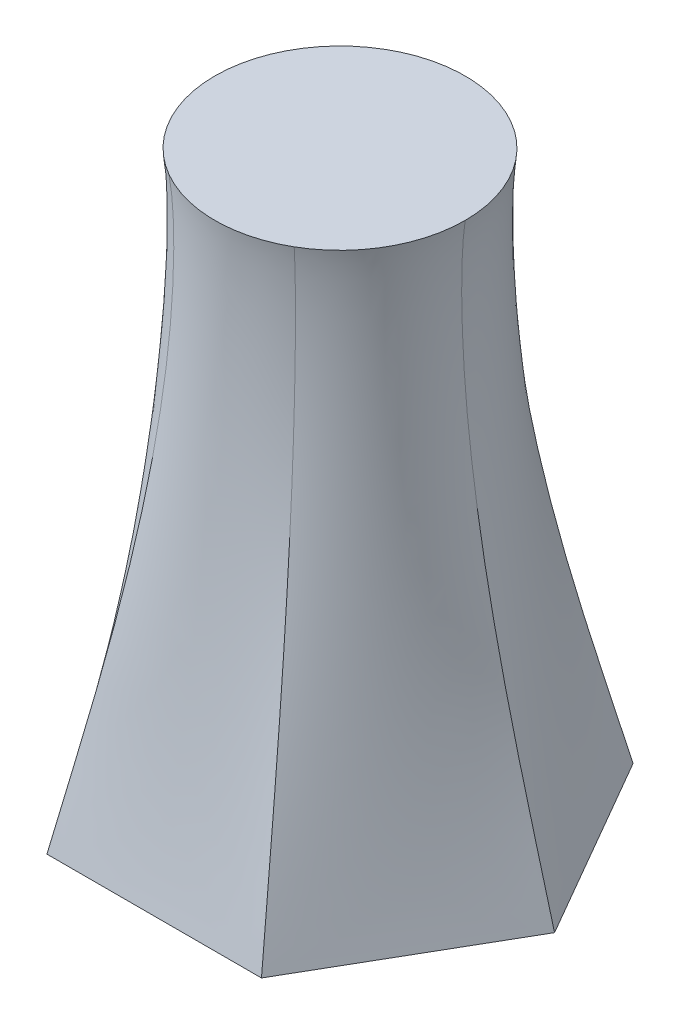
ISO-10303-21;
HEADER;
FILE_DESCRIPTION(('STEP AP214'),'2;1');
FILE_NAME('part.step','',(''),(''),'','','');
FILE_SCHEMA(('AUTOMOTIVE_DESIGN { 1 0 10303 214 1 1 1 1 }'));
ENDSEC;
DATA;
#1=APPLICATION_CONTEXT('core data for automotive mechanical design processes');
#2=APPLICATION_PROTOCOL_DEFINITION('international standard','automotive_design',2000,#1);
#3=PRODUCT_CONTEXT('',#1,'mechanical');
#4=PRODUCT('Part','Part','',(#3));
#5=PRODUCT_RELATED_PRODUCT_CATEGORY('part','',(#4));
#6=PRODUCT_DEFINITION_FORMATION('','',#4);
#7=PRODUCT_DEFINITION_CONTEXT('part definition',#1,'design');
#8=PRODUCT_DEFINITION('design','',#6,#7);
#9=PRODUCT_DEFINITION_SHAPE('','',#8);
#10=(LENGTH_UNIT() NAMED_UNIT(*) SI_UNIT(.MILLI.,.METRE.));
#11=(NAMED_UNIT(*) PLANE_ANGLE_UNIT() SI_UNIT($,.RADIAN.));
#12=(NAMED_UNIT(*) SI_UNIT($,.STERADIAN.) SOLID_ANGLE_UNIT());
#13=UNCERTAINTY_MEASURE_WITH_UNIT(LENGTH_MEASURE(1.E-05),#10,'distance_accuracy_value','');
#14=(GEOMETRIC_REPRESENTATION_CONTEXT(3) GLOBAL_UNCERTAINTY_ASSIGNED_CONTEXT((#13)) GLOBAL_UNIT_ASSIGNED_CONTEXT((#10,
#11,#12)) REPRESENTATION_CONTEXT('',''));
#15=CARTESIAN_POINT('',(0.,0.,0.));
#16=DIRECTION('',(0.,0.,1.));
#17=DIRECTION('',(1.,0.,0.));
#18=AXIS2_PLACEMENT_3D('',#15,#16,#17);
#19=CARTESIAN_POINT('',(0.,160.,0.));
#20=DIRECTION('',(0.,1.,0.));
#21=DIRECTION('',(0.,0.,1.));
#22=AXIS2_PLACEMENT_3D('',#19,#20,#21);
#23=PLANE('',#22);
#24=CARTESIAN_POINT('',(0.,160.,0.));
#25=DIRECTION('',(0.,1.,0.));
#26=DIRECTION('',(0.,0.,1.));
#27=AXIS2_PLACEMENT_3D('',#24,#25,#26);
#28=CIRCLE('',#27,35.);
#29=CARTESIAN_POINT('',(17.5,160.,30.3108891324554));
#30=VERTEX_POINT('',#29);
#31=CARTESIAN_POINT('',(35.,160.,0.));
#32=VERTEX_POINT('',#31);
#33=EDGE_CURVE('E143',#30,#32,#28,.T.);
#34=ORIENTED_EDGE('',*,*,#33,.T.);
#35=CARTESIAN_POINT('',(17.5,160.,-30.3108891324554));
#36=VERTEX_POINT('',#35);
#37=EDGE_CURVE('E152',#32,#36,#28,.T.);
#38=ORIENTED_EDGE('',*,*,#37,.T.);
#39=CARTESIAN_POINT('',(-17.5,160.,-30.3108891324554));
#40=VERTEX_POINT('',#39);
#41=EDGE_CURVE('E180',#36,#40,#28,.T.);
#42=ORIENTED_EDGE('',*,*,#41,.T.);
#43=CARTESIAN_POINT('',(-35.,160.,0.));
#44=VERTEX_POINT('',#43);
#45=EDGE_CURVE('E163',#40,#44,#28,.T.);
#46=ORIENTED_EDGE('',*,*,#45,.T.);
#47=CARTESIAN_POINT('',(-17.5,160.,30.3108891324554));
#48=VERTEX_POINT('',#47);
#49=EDGE_CURVE('E157',#44,#48,#28,.T.);
#50=ORIENTED_EDGE('',*,*,#49,.T.);
#51=EDGE_CURVE('E135',#48,#30,#28,.T.);
#52=ORIENTED_EDGE('',*,*,#51,.T.);
#53=EDGE_LOOP('',(#34,#38,#42,#46,#50,#52));
#54=FACE_BOUND('',#53,.T.);
#55=ADVANCED_FACE('F75',(#54),#23,.T.);
#56=CARTESIAN_POINT('',(30.,0.,51.9615242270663));
#57=DIRECTION('',(0.,-1.,0.));
#58=DIRECTION('',(0.,0.,-1.));
#59=AXIS2_PLACEMENT_3D('',#56,#57,#58);
#60=PLANE('',#59);
#61=DIRECTION('',(0.499999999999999,0.,-0.866025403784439));
#62=VECTOR('',#61,1.);
#63=CARTESIAN_POINT('',(30.,0.,51.9615242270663));
#64=LINE('',#63,#62);
#65=CARTESIAN_POINT('',(30.,0.,51.9615242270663));
#66=VERTEX_POINT('',#65);
#67=CARTESIAN_POINT('',(60.,0.,0.));
#68=VERTEX_POINT('',#67);
#69=EDGE_CURVE('E139',#66,#68,#64,.T.);
#70=ORIENTED_EDGE('',*,*,#69,.F.);
#71=DIRECTION('',(1.,0.,0.));
#72=VECTOR('',#71,1.);
#73=CARTESIAN_POINT('',(-30.,0.,51.9615242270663));
#74=LINE('',#73,#72);
#75=CARTESIAN_POINT('',(-30.,0.,51.9615242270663));
#76=VERTEX_POINT('',#75);
#77=EDGE_CURVE('E12',#76,#66,#74,.T.);
#78=ORIENTED_EDGE('',*,*,#77,.F.);
#79=DIRECTION('',(0.5,0.,0.866025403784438));
#80=VECTOR('',#79,1.);
#81=CARTESIAN_POINT('',(-60.,0.,0.));
#82=LINE('',#81,#80);
#83=CARTESIAN_POINT('',(-60.,0.,0.));
#84=VERTEX_POINT('',#83);
#85=EDGE_CURVE('E87',#84,#76,#82,.T.);
#86=ORIENTED_EDGE('',*,*,#85,.F.);
#87=DIRECTION('',(-0.5,0.,0.866025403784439));
#88=VECTOR('',#87,1.);
#89=CARTESIAN_POINT('',(-30.,0.,-51.9615242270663));
#90=LINE('',#89,#88);
#91=CARTESIAN_POINT('',(-30.,0.,-51.9615242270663));
#92=VERTEX_POINT('',#91);
#93=EDGE_CURVE('E252',#92,#84,#90,.T.);
#94=ORIENTED_EDGE('',*,*,#93,.F.);
#95=DIRECTION('',(-1.,0.,0.));
#96=VECTOR('',#95,1.);
#97=CARTESIAN_POINT('',(30.,0.,-51.9615242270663));
#98=LINE('',#97,#96);
#99=CARTESIAN_POINT('',(30.,0.,-51.9615242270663));
#100=VERTEX_POINT('',#99);
#101=EDGE_CURVE('E234',#100,#92,#98,.T.);
#102=ORIENTED_EDGE('',*,*,#101,.F.);
#103=DIRECTION('',(-0.5,0.,-0.866025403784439));
#104=VECTOR('',#103,1.);
#105=CARTESIAN_POINT('',(60.,0.,0.));
#106=LINE('',#105,#104);
#107=EDGE_CURVE('E336',#68,#100,#106,.T.);
#108=ORIENTED_EDGE('',*,*,#107,.F.);
#109=EDGE_LOOP('',(#70,#78,#86,#94,#102,#108));
#110=FACE_BOUND('',#109,.T.);
#111=ADVANCED_FACE('F77',(#110),#60,.T.);
#112=CARTESIAN_POINT('',(-30.,0.,51.9615242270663));
#113=CARTESIAN_POINT('',(-26.5443279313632,26.4548247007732,45.9761246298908));
#114=CARTESIAN_POINT('',(-17.0487314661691,88.2729550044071,29.5292691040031));
#115=CARTESIAN_POINT('',(-16.822105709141,150.899269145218,29.1367417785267));
#116=CARTESIAN_POINT('',(-17.5,160.,30.3108891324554));
#117=CARTESIAN_POINT('',(-10.,0.,51.9615242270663));
#118=CARTESIAN_POINT('',(-8.8481093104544,26.4548247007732,45.9761246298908));
#119=CARTESIAN_POINT('',(-6.65982607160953,88.2729550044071,36.8062666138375));
#120=CARTESIAN_POINT('',(-6.44657854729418,150.899269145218,35.3879768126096));
#121=CARTESIAN_POINT('',(-6.67254331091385,160.,36.5621241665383));
#122=CARTESIAN_POINT('',(9.99999999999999,0.,51.9615242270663));
#123=CARTESIAN_POINT('',(8.8481093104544,26.4548247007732,45.9761246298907));
#124=CARTESIAN_POINT('',(6.65982607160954,88.2729550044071,36.8062666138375));
#125=CARTESIAN_POINT('',(6.44657854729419,150.899269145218,35.3879768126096));
#126=CARTESIAN_POINT('',(6.67254331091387,160.,36.5621241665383));
#127=CARTESIAN_POINT('',(30.,0.,51.9615242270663));
#128=CARTESIAN_POINT('',(26.5443279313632,26.4548247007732,45.9761246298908));
#129=CARTESIAN_POINT('',(17.0487314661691,88.2729550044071,29.5292691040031));
#130=CARTESIAN_POINT('',(16.822105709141,150.899269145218,29.1367417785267));
#131=CARTESIAN_POINT('',(17.5,160.,30.3108891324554));
#132=B_SPLINE_SURFACE_WITH_KNOTS('',3,3,((#112,#113,#114,#115,#116),(#117,#118,#119,#120,#121),
(#122,#123,#124,#125,#126),(#127,#128,#129,#130,#131)),.UNSPECIFIED.,.F.,.F.,.F.,(4,4),(4,1,4),
(0.,1.),(0.,0.752910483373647,1.),.UNSPECIFIED.);
#133=CARTESIAN_POINT('',(30.,0.,51.9615242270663));
#134=CARTESIAN_POINT('',(26.5443279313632,26.4548247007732,45.9761246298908));
#135=CARTESIAN_POINT('',(17.0487314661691,88.2729550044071,29.5292691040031));
#136=CARTESIAN_POINT('',(16.822105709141,150.899269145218,29.1367417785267));
#137=CARTESIAN_POINT('',(17.5,160.,30.3108891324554));
#138=B_SPLINE_CURVE_WITH_KNOTS('',3,(#133,#134,#135,#136,#137),.UNSPECIFIED.,.F.,.F.,(4,1,4),
(0.,0.752910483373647,1.),.UNSPECIFIED.);
#139=EDGE_CURVE('E95',#66,#30,#138,.T.);
#140=CARTESIAN_POINT('',(-30.,0.,51.9615242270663));
#141=CARTESIAN_POINT('',(-26.5443279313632,26.4548247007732,45.9761246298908));
#142=CARTESIAN_POINT('',(-17.0487314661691,88.2729550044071,29.5292691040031));
#143=CARTESIAN_POINT('',(-16.822105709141,150.899269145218,29.1367417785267));
#144=CARTESIAN_POINT('',(-17.5,160.,30.3108891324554));
#145=B_SPLINE_CURVE_WITH_KNOTS('',3,(#140,#141,#142,#143,#144),.UNSPECIFIED.,.F.,.F.,(4,1,4),
(0.,0.752910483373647,1.),.UNSPECIFIED.);
#146=EDGE_CURVE('E140',#48,#76,#145,.F.);
#147=ORIENTED_EDGE('',*,*,#77,.T.);
#148=ORIENTED_EDGE('',*,*,#139,.T.);
#149=ORIENTED_EDGE('',*,*,#51,.F.);
#150=ORIENTED_EDGE('',*,*,#146,.T.);
#151=EDGE_LOOP('',(#147,#148,#149,#150));
#152=FACE_BOUND('',#151,.T.);
#153=ADVANCED_FACE('F132',(#152),#132,.T.);
#154=CARTESIAN_POINT('',(30.,0.,51.9615242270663));
#155=CARTESIAN_POINT('',(26.5443279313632,26.4548247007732,45.9761246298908));
#156=CARTESIAN_POINT('',(17.0487314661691,88.2729550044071,29.5292691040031));
#157=CARTESIAN_POINT('',(16.822105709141,150.899269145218,29.1367417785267));
#158=CARTESIAN_POINT('',(17.5,160.,30.3108891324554));
#159=CARTESIAN_POINT('',(40.,0.,34.6410161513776));
#160=CARTESIAN_POINT('',(35.3924372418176,26.4548247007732,30.6507497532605));
#161=CARTESIAN_POINT('',(28.5452488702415,88.2729550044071,24.1707118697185));
#162=CARTESIAN_POINT('',(27.4235976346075,150.899269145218,23.2768891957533));
#163=CARTESIAN_POINT('',(28.3274566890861,160.,24.0596540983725));
#164=CARTESIAN_POINT('',(50.,0.,17.3205080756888));
#165=CARTESIAN_POINT('',(44.240546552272,26.4548247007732,15.3253748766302));
#166=CARTESIAN_POINT('',(35.2050749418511,88.2729550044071,12.635554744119));
#167=CARTESIAN_POINT('',(33.8701761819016,150.899269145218,12.1110876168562));
#168=CARTESIAN_POINT('',(35.,160.,12.5024700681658));
#169=CARTESIAN_POINT('',(60.,0.,0.));
#170=CARTESIAN_POINT('',(53.0886558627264,26.4548247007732,0.));
#171=CARTESIAN_POINT('',(34.0974629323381,88.2729550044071,0.));
#172=CARTESIAN_POINT('',(33.644211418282,150.899269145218,0.));
#173=CARTESIAN_POINT('',(35.,160.,0.));
#174=B_SPLINE_SURFACE_WITH_KNOTS('',3,3,((#154,#155,#156,#157,#158),(#159,#160,#161,#162,#163),
(#164,#165,#166,#167,#168),(#169,#170,#171,#172,#173)),.UNSPECIFIED.,.F.,.F.,.F.,(4,4),(4,1,4),
(0.,1.),(0.,0.752910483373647,1.),.UNSPECIFIED.);
#175=CARTESIAN_POINT('',(60.,0.,0.));
#176=CARTESIAN_POINT('',(53.0886558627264,26.4548247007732,0.));
#177=CARTESIAN_POINT('',(34.0974629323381,88.2729550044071,0.));
#178=CARTESIAN_POINT('',(33.644211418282,150.899269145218,0.));
#179=CARTESIAN_POINT('',(35.,160.,0.));
#180=B_SPLINE_CURVE_WITH_KNOTS('',3,(#175,#176,#177,#178,#179),.UNSPECIFIED.,.F.,.F.,(4,1,4),
(0.,0.752910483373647,1.),.UNSPECIFIED.);
#181=EDGE_CURVE('E147',#68,#32,#180,.T.);
#182=ORIENTED_EDGE('',*,*,#69,.T.);
#183=ORIENTED_EDGE('',*,*,#181,.T.);
#184=ORIENTED_EDGE('',*,*,#33,.F.);
#185=ORIENTED_EDGE('',*,*,#139,.F.);
#186=EDGE_LOOP('',(#182,#183,#184,#185));
#187=FACE_BOUND('',#186,.T.);
#188=ADVANCED_FACE('F145',(#187),#174,.T.);
#189=CARTESIAN_POINT('',(-60.,0.,0.));
#190=CARTESIAN_POINT('',(-53.0886558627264,26.4548247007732,0.));
#191=CARTESIAN_POINT('',(-34.0974629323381,88.2729550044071,0.));
#192=CARTESIAN_POINT('',(-33.644211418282,150.899269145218,0.));
#193=CARTESIAN_POINT('',(-35.,160.,0.));
#194=CARTESIAN_POINT('',(-50.,0.,17.3205080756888));
#195=CARTESIAN_POINT('',(-44.240546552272,26.4548247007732,15.3253748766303));
#196=CARTESIAN_POINT('',(-35.2050749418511,88.2729550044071,12.635554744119));
#197=CARTESIAN_POINT('',(-33.8701761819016,150.899269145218,12.1110876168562));
#198=CARTESIAN_POINT('',(-35.,160.,12.5024700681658));
#199=CARTESIAN_POINT('',(-40.,0.,34.6410161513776));
#200=CARTESIAN_POINT('',(-35.3924372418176,26.4548247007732,30.6507497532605));
#201=CARTESIAN_POINT('',(-28.5452488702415,88.2729550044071,24.1707118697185));
#202=CARTESIAN_POINT('',(-27.4235976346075,150.899269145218,23.2768891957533));
#203=CARTESIAN_POINT('',(-28.3274566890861,160.,24.0596540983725));
#204=CARTESIAN_POINT('',(-30.,0.,51.9615242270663));
#205=CARTESIAN_POINT('',(-26.5443279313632,26.4548247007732,45.9761246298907));
#206=CARTESIAN_POINT('',(-17.0487314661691,88.2729550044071,29.5292691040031));
#207=CARTESIAN_POINT('',(-16.822105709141,150.899269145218,29.1367417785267));
#208=CARTESIAN_POINT('',(-17.5,160.,30.3108891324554));
#209=B_SPLINE_SURFACE_WITH_KNOTS('',3,3,((#189,#190,#191,#192,#193),(#194,#195,#196,#197,#198),
(#199,#200,#201,#202,#203),(#204,#205,#206,#207,#208)),.UNSPECIFIED.,.F.,.F.,.F.,(4,4),(4,1,4),
(0.,1.),(0.,0.752910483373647,1.),.UNSPECIFIED.);
#210=CARTESIAN_POINT('',(-60.,0.,0.));
#211=CARTESIAN_POINT('',(-53.0886558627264,26.4548247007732,0.));
#212=CARTESIAN_POINT('',(-34.0974629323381,88.2729550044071,0.));
#213=CARTESIAN_POINT('',(-33.644211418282,150.899269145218,0.));
#214=CARTESIAN_POINT('',(-35.,160.,0.));
#215=B_SPLINE_CURVE_WITH_KNOTS('',3,(#210,#211,#212,#213,#214),.UNSPECIFIED.,.F.,.F.,(4,1,4),
(0.,0.752910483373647,1.),.UNSPECIFIED.);
#216=EDGE_CURVE('E151',#84,#44,#215,.T.);
#217=ORIENTED_EDGE('',*,*,#85,.T.);
#218=ORIENTED_EDGE('',*,*,#146,.F.);
#219=ORIENTED_EDGE('',*,*,#49,.F.);
#220=ORIENTED_EDGE('',*,*,#216,.F.);
#221=EDGE_LOOP('',(#217,#218,#219,#220));
#222=FACE_BOUND('',#221,.T.);
#223=ADVANCED_FACE('F273',(#222),#209,.T.);
#224=CARTESIAN_POINT('',(60.,0.,0.));
#225=CARTESIAN_POINT('',(53.0886558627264,26.4548247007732,0.));
#226=CARTESIAN_POINT('',(34.0974629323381,88.2729550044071,0.));
#227=CARTESIAN_POINT('',(33.644211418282,150.899269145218,0.));
#228=CARTESIAN_POINT('',(35.,160.,0.));
#229=CARTESIAN_POINT('',(50.,0.,-17.3205080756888));
#230=CARTESIAN_POINT('',(44.240546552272,26.4548247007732,-15.3253748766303));
#231=CARTESIAN_POINT('',(35.2050749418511,88.2729550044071,-12.635554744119));
#232=CARTESIAN_POINT('',(33.8701761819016,150.899269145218,-12.1110876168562));
#233=CARTESIAN_POINT('',(35.,160.,-12.5024700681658));
#234=CARTESIAN_POINT('',(40.,0.,-34.6410161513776));
#235=CARTESIAN_POINT('',(35.3924372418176,26.4548247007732,-30.6507497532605));
#236=CARTESIAN_POINT('',(28.5452488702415,88.2729550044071,-24.1707118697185));
#237=CARTESIAN_POINT('',(27.4235976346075,150.899269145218,-23.2768891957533));
#238=CARTESIAN_POINT('',(28.3274566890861,160.,-24.0596540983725));
#239=CARTESIAN_POINT('',(30.,0.,-51.9615242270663));
#240=CARTESIAN_POINT('',(26.5443279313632,26.4548247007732,-45.9761246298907));
#241=CARTESIAN_POINT('',(17.0487314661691,88.2729550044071,-29.5292691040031));
#242=CARTESIAN_POINT('',(16.822105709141,150.899269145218,-29.1367417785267));
#243=CARTESIAN_POINT('',(17.5,160.,-30.3108891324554));
#244=B_SPLINE_SURFACE_WITH_KNOTS('',3,3,((#224,#225,#226,#227,#228),(#229,#230,#231,#232,#233),
(#234,#235,#236,#237,#238),(#239,#240,#241,#242,#243)),.UNSPECIFIED.,.F.,.F.,.F.,(4,4),(4,1,4),
(0.,1.),(0.,0.752910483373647,1.),.UNSPECIFIED.);
#245=CARTESIAN_POINT('',(30.,0.,-51.9615242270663));
#246=CARTESIAN_POINT('',(26.5443279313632,26.4548247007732,-45.9761246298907));
#247=CARTESIAN_POINT('',(17.0487314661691,88.2729550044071,-29.5292691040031));
#248=CARTESIAN_POINT('',(16.822105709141,150.899269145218,-29.1367417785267));
#249=CARTESIAN_POINT('',(17.5,160.,-30.3108891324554));
#250=B_SPLINE_CURVE_WITH_KNOTS('',3,(#245,#246,#247,#248,#249),.UNSPECIFIED.,.F.,.F.,(4,1,4),
(0.,0.752910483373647,1.),.UNSPECIFIED.);
#251=EDGE_CURVE('E236',#100,#36,#250,.T.);
#252=ORIENTED_EDGE('',*,*,#107,.T.);
#253=ORIENTED_EDGE('',*,*,#251,.T.);
#254=ORIENTED_EDGE('',*,*,#37,.F.);
#255=ORIENTED_EDGE('',*,*,#181,.F.);
#256=EDGE_LOOP('',(#252,#253,#254,#255));
#257=FACE_BOUND('',#256,.T.);
#258=ADVANCED_FACE('F285',(#257),#244,.T.);
#259=CARTESIAN_POINT('',(30.,0.,-51.9615242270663));
#260=CARTESIAN_POINT('',(26.5443279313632,26.4548247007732,-45.9761246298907));
#261=CARTESIAN_POINT('',(17.0487314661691,88.2729550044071,-29.5292691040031));
#262=CARTESIAN_POINT('',(16.822105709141,150.899269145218,-29.1367417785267));
#263=CARTESIAN_POINT('',(17.5,160.,-30.3108891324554));
#264=CARTESIAN_POINT('',(9.99999999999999,0.,-51.9615242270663));
#265=CARTESIAN_POINT('',(8.84810931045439,26.4548247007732,-45.9761246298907));
#266=CARTESIAN_POINT('',(6.65982607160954,88.2729550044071,-36.8062666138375));
#267=CARTESIAN_POINT('',(6.44657854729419,150.899269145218,-35.3879768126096));
#268=CARTESIAN_POINT('',(6.67254331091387,160.,-36.5621241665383));
#269=CARTESIAN_POINT('',(-10.,0.,-51.9615242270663));
#270=CARTESIAN_POINT('',(-8.8481093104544,26.4548247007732,-45.9761246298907));
#271=CARTESIAN_POINT('',(-6.65982607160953,88.2729550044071,-36.8062666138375));
#272=CARTESIAN_POINT('',(-6.44657854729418,150.899269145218,-35.3879768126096));
#273=CARTESIAN_POINT('',(-6.67254331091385,160.,-36.5621241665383));
#274=CARTESIAN_POINT('',(-30.,0.,-51.9615242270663));
#275=CARTESIAN_POINT('',(-26.5443279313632,26.4548247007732,-45.9761246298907));
#276=CARTESIAN_POINT('',(-17.0487314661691,88.2729550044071,-29.5292691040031));
#277=CARTESIAN_POINT('',(-16.822105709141,150.899269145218,-29.1367417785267));
#278=CARTESIAN_POINT('',(-17.5,160.,-30.3108891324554));
#279=B_SPLINE_SURFACE_WITH_KNOTS('',3,3,((#259,#260,#261,#262,#263),(#264,#265,#266,#267,#268),
(#269,#270,#271,#272,#273),(#274,#275,#276,#277,#278)),.UNSPECIFIED.,.F.,.F.,.F.,(4,4),(4,1,4),
(0.,1.),(0.,0.752910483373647,1.),.UNSPECIFIED.);
#280=CARTESIAN_POINT('',(-30.,0.,-51.9615242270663));
#281=CARTESIAN_POINT('',(-26.5443279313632,26.4548247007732,-45.9761246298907));
#282=CARTESIAN_POINT('',(-17.0487314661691,88.2729550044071,-29.5292691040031));
#283=CARTESIAN_POINT('',(-16.822105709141,150.899269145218,-29.1367417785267));
#284=CARTESIAN_POINT('',(-17.5,160.,-30.3108891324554));
#285=B_SPLINE_CURVE_WITH_KNOTS('',3,(#280,#281,#282,#283,#284),.UNSPECIFIED.,.F.,.F.,(4,1,4),
(0.,0.752910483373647,1.),.UNSPECIFIED.);
#286=EDGE_CURVE('E228',#92,#40,#285,.T.);
#287=ORIENTED_EDGE('',*,*,#101,.T.);
#288=ORIENTED_EDGE('',*,*,#286,.T.);
#289=ORIENTED_EDGE('',*,*,#41,.F.);
#290=ORIENTED_EDGE('',*,*,#251,.F.);
#291=EDGE_LOOP('',(#287,#288,#289,#290));
#292=FACE_BOUND('',#291,.T.);
#293=ADVANCED_FACE('F233',(#292),#279,.T.);
#294=CARTESIAN_POINT('',(-30.,0.,-51.9615242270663));
#295=CARTESIAN_POINT('',(-26.5443279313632,26.4548247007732,-45.9761246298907));
#296=CARTESIAN_POINT('',(-17.0487314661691,88.2729550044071,-29.5292691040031));
#297=CARTESIAN_POINT('',(-16.822105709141,150.899269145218,-29.1367417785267));
#298=CARTESIAN_POINT('',(-17.5,160.,-30.3108891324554));
#299=CARTESIAN_POINT('',(-40.,0.,-34.6410161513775));
#300=CARTESIAN_POINT('',(-35.3924372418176,26.4548247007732,-30.6507497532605));
#301=CARTESIAN_POINT('',(-28.5452488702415,88.2729550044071,-24.1707118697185));
#302=CARTESIAN_POINT('',(-27.4235976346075,150.899269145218,-23.2768891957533));
#303=CARTESIAN_POINT('',(-28.3274566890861,160.,-24.0596540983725));
#304=CARTESIAN_POINT('',(-50.,0.,-17.3205080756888));
#305=CARTESIAN_POINT('',(-44.240546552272,26.4548247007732,-15.3253748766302));
#306=CARTESIAN_POINT('',(-35.2050749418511,88.2729550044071,-12.635554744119));
#307=CARTESIAN_POINT('',(-33.8701761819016,150.899269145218,-12.1110876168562));
#308=CARTESIAN_POINT('',(-35.,160.,-12.5024700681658));
#309=CARTESIAN_POINT('',(-60.,0.,0.));
#310=CARTESIAN_POINT('',(-53.0886558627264,26.4548247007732,0.));
#311=CARTESIAN_POINT('',(-34.0974629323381,88.2729550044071,0.));
#312=CARTESIAN_POINT('',(-33.644211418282,150.899269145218,0.));
#313=CARTESIAN_POINT('',(-35.,160.,0.));
#314=B_SPLINE_SURFACE_WITH_KNOTS('',3,3,((#294,#295,#296,#297,#298),(#299,#300,#301,#302,#303),
(#304,#305,#306,#307,#308),(#309,#310,#311,#312,#313)),.UNSPECIFIED.,.F.,.F.,.F.,(4,4),(4,1,4),
(0.,1.),(0.,0.752910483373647,1.),.UNSPECIFIED.);
#315=ORIENTED_EDGE('',*,*,#93,.T.);
#316=ORIENTED_EDGE('',*,*,#216,.T.);
#317=ORIENTED_EDGE('',*,*,#45,.F.);
#318=ORIENTED_EDGE('',*,*,#286,.F.);
#319=EDGE_LOOP('',(#315,#316,#317,#318));
#320=FACE_BOUND('',#319,.T.);
#321=ADVANCED_FACE('F195',(#320),#314,.T.);
#322=CLOSED_SHELL('',(#55,#111,#153,#188,#223,#258,#293,#321));
#323=MANIFOLD_SOLID_BREP('B2',#322);
#324=ADVANCED_BREP_SHAPE_REPRESENTATION('',(#18,#323),#14);
#325=SHAPE_DEFINITION_REPRESENTATION(#9,#324);
ENDSEC;
END-ISO-10303-21;
